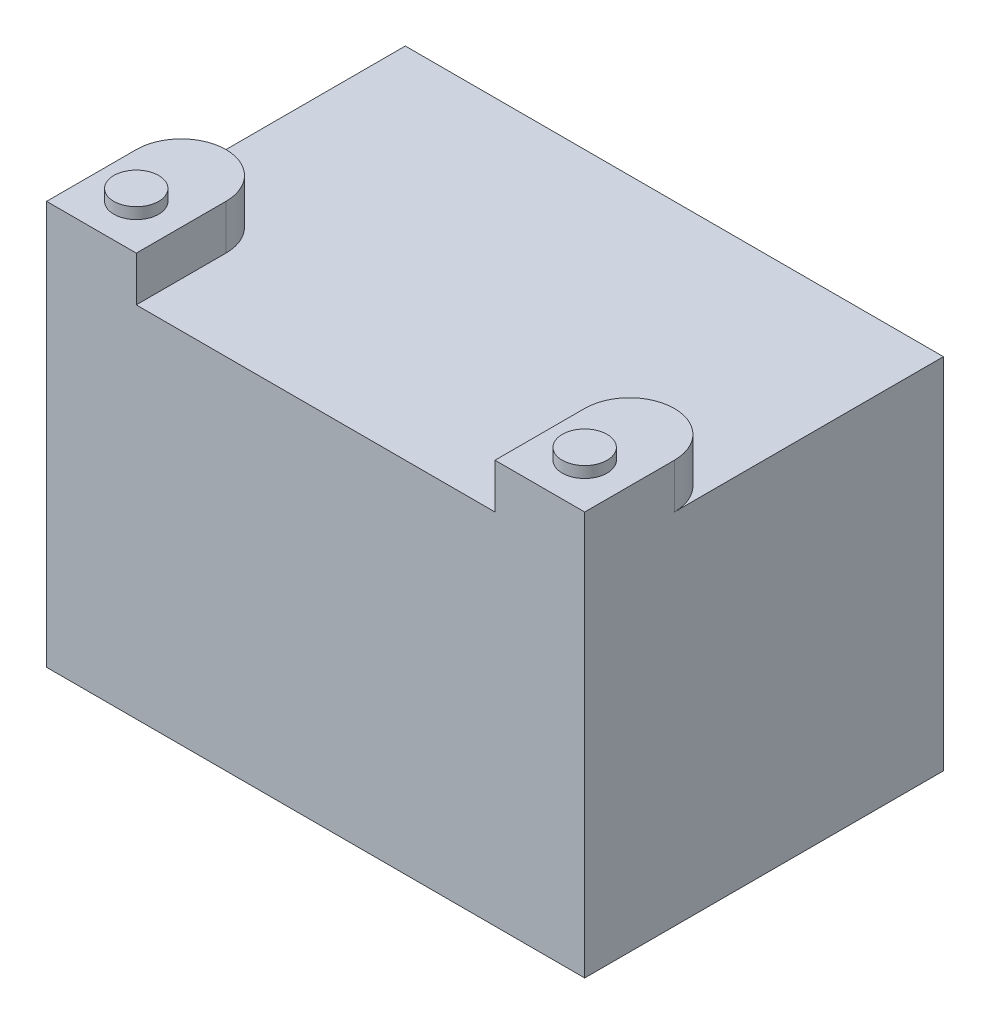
ISO-10303-21;
HEADER;
FILE_DESCRIPTION(('STEP AP214'),'2;1');
FILE_NAME('part.step','',(''),(''),'','','');
FILE_SCHEMA(('AUTOMOTIVE_DESIGN { 1 0 10303 214 1 1 1 1 }'));
ENDSEC;
DATA;
#1=APPLICATION_CONTEXT('core data for automotive mechanical design processes');
#2=APPLICATION_PROTOCOL_DEFINITION('international standard','automotive_design',2000,#1);
#3=PRODUCT_CONTEXT('',#1,'mechanical');
#4=PRODUCT('Part','Part','',(#3));
#5=PRODUCT_RELATED_PRODUCT_CATEGORY('part','',(#4));
#6=PRODUCT_DEFINITION_FORMATION('','',#4);
#7=PRODUCT_DEFINITION_CONTEXT('part definition',#1,'design');
#8=PRODUCT_DEFINITION('design','',#6,#7);
#9=PRODUCT_DEFINITION_SHAPE('','',#8);
#10=(LENGTH_UNIT() NAMED_UNIT(*) SI_UNIT(.MILLI.,.METRE.));
#11=(NAMED_UNIT(*) PLANE_ANGLE_UNIT() SI_UNIT($,.RADIAN.));
#12=(NAMED_UNIT(*) SI_UNIT($,.STERADIAN.) SOLID_ANGLE_UNIT());
#13=UNCERTAINTY_MEASURE_WITH_UNIT(LENGTH_MEASURE(1.E-05),#10,'distance_accuracy_value','');
#14=(GEOMETRIC_REPRESENTATION_CONTEXT(3) GLOBAL_UNCERTAINTY_ASSIGNED_CONTEXT((#13)) GLOBAL_UNIT_ASSIGNED_CONTEXT((#10,
#11,#12)) REPRESENTATION_CONTEXT('',''));
#15=CARTESIAN_POINT('',(0.,0.,0.));
#16=DIRECTION('',(0.,0.,1.));
#17=DIRECTION('',(1.,0.,0.));
#18=AXIS2_PLACEMENT_3D('',#15,#16,#17);
#19=CARTESIAN_POINT('',(0.,101.6,0.));
#20=DIRECTION('',(0.,-1.,0.));
#21=DIRECTION('',(0.,0.,-1.));
#22=AXIS2_PLACEMENT_3D('',#19,#20,#21);
#23=PLANE('',#22);
#24=CARTESIAN_POINT('',(139.7,101.6,-25.4));
#25=DIRECTION('',(0.,1.,0.));
#26=DIRECTION('',(0.,0.,1.));
#27=AXIS2_PLACEMENT_3D('',#24,#25,#26);
#28=CIRCLE('',#27,12.7000000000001);
#29=CARTESIAN_POINT('',(152.4,101.6,-25.3999980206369));
#30=VERTEX_POINT('',#29);
#31=CARTESIAN_POINT('',(127.,101.6,-25.4));
#32=VERTEX_POINT('',#31);
#33=EDGE_CURVE('E247',#30,#32,#28,.T.);
#34=ORIENTED_EDGE('',*,*,#33,.F.);
#35=DIRECTION('',(0.,0.,-1.));
#36=VECTOR('',#35,1.);
#37=CARTESIAN_POINT('',(152.4,101.6,0.));
#38=LINE('',#37,#36);
#39=CARTESIAN_POINT('',(152.4,101.6,-101.6));
#40=VERTEX_POINT('',#39);
#41=EDGE_CURVE('E142',#30,#40,#38,.T.);
#42=ORIENTED_EDGE('',*,*,#41,.T.);
#43=DIRECTION('',(-1.,0.,0.));
#44=VECTOR('',#43,1.);
#45=CARTESIAN_POINT('',(0.,101.6,-101.6));
#46=LINE('',#45,#44);
#47=CARTESIAN_POINT('',(0.,101.6,-101.6));
#48=VERTEX_POINT('',#47);
#49=EDGE_CURVE('E192',#40,#48,#46,.T.);
#50=ORIENTED_EDGE('',*,*,#49,.T.);
#51=DIRECTION('',(0.,0.,1.));
#52=VECTOR('',#51,1.);
#53=CARTESIAN_POINT('',(0.,101.6,0.));
#54=LINE('',#53,#52);
#55=CARTESIAN_POINT('',(0.,101.6,-25.4));
#56=VERTEX_POINT('',#55);
#57=EDGE_CURVE('E184',#48,#56,#54,.T.);
#58=ORIENTED_EDGE('',*,*,#57,.T.);
#59=CARTESIAN_POINT('',(12.7,101.6,-25.4));
#60=DIRECTION('',(0.,1.,0.));
#61=DIRECTION('',(0.,0.,1.));
#62=AXIS2_PLACEMENT_3D('',#59,#60,#61);
#63=CIRCLE('',#62,12.7);
#64=CARTESIAN_POINT('',(25.4,101.6,-25.4));
#65=VERTEX_POINT('',#64);
#66=EDGE_CURVE('E149',#65,#56,#63,.T.);
#67=ORIENTED_EDGE('',*,*,#66,.F.);
#68=DIRECTION('',(0.,0.,-1.));
#69=VECTOR('',#68,1.);
#70=CARTESIAN_POINT('',(25.4,101.6,0.));
#71=LINE('',#70,#69);
#72=CARTESIAN_POINT('',(25.4,101.6,0.));
#73=VERTEX_POINT('',#72);
#74=EDGE_CURVE('E144',#73,#65,#71,.T.);
#75=ORIENTED_EDGE('',*,*,#74,.F.);
#76=DIRECTION('',(1.,0.,0.));
#77=VECTOR('',#76,1.);
#78=CARTESIAN_POINT('',(0.,101.6,0.));
#79=LINE('',#78,#77);
#80=CARTESIAN_POINT('',(127.,101.6,0.));
#81=VERTEX_POINT('',#80);
#82=EDGE_CURVE('E62',#73,#81,#79,.T.);
#83=ORIENTED_EDGE('',*,*,#82,.T.);
#84=DIRECTION('',(0.,0.,1.));
#85=VECTOR('',#84,1.);
#86=CARTESIAN_POINT('',(127.,101.6,0.));
#87=LINE('',#86,#85);
#88=EDGE_CURVE('E57',#32,#81,#87,.T.);
#89=ORIENTED_EDGE('',*,*,#88,.F.);
#90=EDGE_LOOP('',(#34,#42,#50,#58,#67,#75,#83,#89));
#91=FACE_BOUND('',#90,.T.);
#92=ADVANCED_FACE('F41',(#91),#23,.F.);
#93=CARTESIAN_POINT('',(0.,101.6,0.));
#94=DIRECTION('',(1.,0.,0.));
#95=DIRECTION('',(0.,0.,-1.));
#96=AXIS2_PLACEMENT_3D('',#93,#94,#95);
#97=PLANE('',#96);
#98=DIRECTION('',(0.,0.,1.));
#99=VECTOR('',#98,1.);
#100=CARTESIAN_POINT('',(0.,0.,0.));
#101=LINE('',#100,#99);
#102=CARTESIAN_POINT('',(0.,0.,-101.6));
#103=VERTEX_POINT('',#102);
#104=CARTESIAN_POINT('',(0.,0.,0.));
#105=VERTEX_POINT('',#104);
#106=EDGE_CURVE('E183',#103,#105,#101,.T.);
#107=ORIENTED_EDGE('',*,*,#106,.T.);
#108=DIRECTION('',(0.,-1.,0.));
#109=VECTOR('',#108,1.);
#110=CARTESIAN_POINT('',(0.,101.6,0.));
#111=LINE('',#110,#109);
#112=CARTESIAN_POINT('',(0.,114.3,0.));
#113=VERTEX_POINT('',#112);
#114=EDGE_CURVE('E11',#113,#105,#111,.T.);
#115=ORIENTED_EDGE('',*,*,#114,.F.);
#116=DIRECTION('',(0.,0.,1.));
#117=VECTOR('',#116,1.);
#118=CARTESIAN_POINT('',(0.,114.3,0.));
#119=LINE('',#118,#117);
#120=CARTESIAN_POINT('',(0.,114.3,-25.4));
#121=VERTEX_POINT('',#120);
#122=EDGE_CURVE('E155',#121,#113,#119,.T.);
#123=ORIENTED_EDGE('',*,*,#122,.F.);
#124=DIRECTION('',(0.,-1.,0.));
#125=VECTOR('',#124,1.);
#126=CARTESIAN_POINT('',(0.,114.3,-25.4));
#127=LINE('',#126,#125);
#128=EDGE_CURVE('E167',#121,#56,#127,.T.);
#129=ORIENTED_EDGE('',*,*,#128,.T.);
#130=ORIENTED_EDGE('',*,*,#57,.F.);
#131=DIRECTION('',(0.,-1.,0.));
#132=VECTOR('',#131,1.);
#133=CARTESIAN_POINT('',(0.,101.6,-101.6));
#134=LINE('',#133,#132);
#135=EDGE_CURVE('E195',#48,#103,#134,.T.);
#136=ORIENTED_EDGE('',*,*,#135,.T.);
#137=EDGE_LOOP('',(#107,#115,#123,#129,#130,#136));
#138=FACE_BOUND('',#137,.T.);
#139=ADVANCED_FACE('F43',(#138),#97,.F.);
#140=CARTESIAN_POINT('',(0.,101.6,0.));
#141=DIRECTION('',(0.,0.,-1.));
#142=DIRECTION('',(-1.,0.,0.));
#143=AXIS2_PLACEMENT_3D('',#140,#141,#142);
#144=PLANE('',#143);
#145=DIRECTION('',(1.,0.,0.));
#146=VECTOR('',#145,1.);
#147=CARTESIAN_POINT('',(0.,0.,0.));
#148=LINE('',#147,#146);
#149=CARTESIAN_POINT('',(152.4,0.,0.));
#150=VERTEX_POINT('',#149);
#151=EDGE_CURVE('E199',#105,#150,#148,.T.);
#152=ORIENTED_EDGE('',*,*,#151,.T.);
#153=DIRECTION('',(0.,-1.,0.));
#154=VECTOR('',#153,1.);
#155=CARTESIAN_POINT('',(152.4,101.6,0.));
#156=LINE('',#155,#154);
#157=CARTESIAN_POINT('',(152.4,114.3,0.));
#158=VERTEX_POINT('',#157);
#159=EDGE_CURVE('E50',#158,#150,#156,.T.);
#160=ORIENTED_EDGE('',*,*,#159,.F.);
#161=DIRECTION('',(1.,0.,0.));
#162=VECTOR('',#161,1.);
#163=CARTESIAN_POINT('',(152.4,114.3,0.));
#164=LINE('',#163,#162);
#165=CARTESIAN_POINT('',(127.,114.3,0.));
#166=VERTEX_POINT('',#165);
#167=EDGE_CURVE('E135',#166,#158,#164,.T.);
#168=ORIENTED_EDGE('',*,*,#167,.F.);
#169=DIRECTION('',(0.,-1.,0.));
#170=VECTOR('',#169,1.);
#171=CARTESIAN_POINT('',(127.,114.3,0.));
#172=LINE('',#171,#170);
#173=EDGE_CURVE('E151',#166,#81,#172,.T.);
#174=ORIENTED_EDGE('',*,*,#173,.T.);
#175=ORIENTED_EDGE('',*,*,#82,.F.);
#176=DIRECTION('',(0.,-1.,0.));
#177=VECTOR('',#176,1.);
#178=CARTESIAN_POINT('',(25.4,114.3,0.));
#179=LINE('',#178,#177);
#180=CARTESIAN_POINT('',(25.4,114.3,0.));
#181=VERTEX_POINT('',#180);
#182=EDGE_CURVE('E179',#181,#73,#179,.T.);
#183=ORIENTED_EDGE('',*,*,#182,.F.);
#184=DIRECTION('',(1.,0.,0.));
#185=VECTOR('',#184,1.);
#186=CARTESIAN_POINT('',(0.,114.3,0.));
#187=LINE('',#186,#185);
#188=EDGE_CURVE('E159',#113,#181,#187,.T.);
#189=ORIENTED_EDGE('',*,*,#188,.F.);
#190=ORIENTED_EDGE('',*,*,#114,.T.);
#191=EDGE_LOOP('',(#152,#160,#168,#174,#175,#183,#189,#190));
#192=FACE_BOUND('',#191,.T.);
#193=ADVANCED_FACE('F237',(#192),#144,.F.);
#194=CARTESIAN_POINT('',(152.4,101.6,0.));
#195=DIRECTION('',(-1.,0.,0.));
#196=DIRECTION('',(0.,0.,1.));
#197=AXIS2_PLACEMENT_3D('',#194,#195,#196);
#198=PLANE('',#197);
#199=DIRECTION('',(0.,0.,-1.));
#200=VECTOR('',#199,1.);
#201=CARTESIAN_POINT('',(152.4,0.,0.));
#202=LINE('',#201,#200);
#203=CARTESIAN_POINT('',(152.4,0.,-101.6));
#204=VERTEX_POINT('',#203);
#205=EDGE_CURVE('E202',#150,#204,#202,.T.);
#206=ORIENTED_EDGE('',*,*,#205,.T.);
#207=DIRECTION('',(0.,-1.,0.));
#208=VECTOR('',#207,1.);
#209=CARTESIAN_POINT('',(152.4,101.6,-101.6));
#210=LINE('',#209,#208);
#211=EDGE_CURVE('E210',#40,#204,#210,.T.);
#212=ORIENTED_EDGE('',*,*,#211,.F.);
#213=ORIENTED_EDGE('',*,*,#41,.F.);
#214=DIRECTION('',(0.,-1.,0.));
#215=VECTOR('',#214,1.);
#216=CARTESIAN_POINT('',(152.4,114.3,-25.3999980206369));
#217=LINE('',#216,#215);
#218=CARTESIAN_POINT('',(152.4,114.3,-25.3999980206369));
#219=VERTEX_POINT('',#218);
#220=EDGE_CURVE('E122',#219,#30,#217,.T.);
#221=ORIENTED_EDGE('',*,*,#220,.F.);
#222=DIRECTION('',(0.,0.,-1.));
#223=VECTOR('',#222,1.);
#224=CARTESIAN_POINT('',(152.4,114.3,0.));
#225=LINE('',#224,#223);
#226=EDGE_CURVE('E129',#158,#219,#225,.T.);
#227=ORIENTED_EDGE('',*,*,#226,.F.);
#228=ORIENTED_EDGE('',*,*,#159,.T.);
#229=EDGE_LOOP('',(#206,#212,#213,#221,#227,#228));
#230=FACE_BOUND('',#229,.T.);
#231=ADVANCED_FACE('F140',(#230),#198,.F.);
#232=CARTESIAN_POINT('',(0.,101.6,-101.6));
#233=DIRECTION('',(0.,0.,1.));
#234=DIRECTION('',(1.,0.,0.));
#235=AXIS2_PLACEMENT_3D('',#232,#233,#234);
#236=PLANE('',#235);
#237=DIRECTION('',(-1.,0.,0.));
#238=VECTOR('',#237,1.);
#239=CARTESIAN_POINT('',(0.,0.,-101.6));
#240=LINE('',#239,#238);
#241=EDGE_CURVE('E187',#204,#103,#240,.T.);
#242=ORIENTED_EDGE('',*,*,#241,.T.);
#243=ORIENTED_EDGE('',*,*,#135,.F.);
#244=ORIENTED_EDGE('',*,*,#49,.F.);
#245=ORIENTED_EDGE('',*,*,#211,.T.);
#246=EDGE_LOOP('',(#242,#243,#244,#245));
#247=FACE_BOUND('',#246,.T.);
#248=ADVANCED_FACE('F222',(#247),#236,.F.);
#249=CARTESIAN_POINT('',(0.,0.,0.));
#250=DIRECTION('',(0.,-1.,0.));
#251=DIRECTION('',(0.,0.,-1.));
#252=AXIS2_PLACEMENT_3D('',#249,#250,#251);
#253=PLANE('',#252);
#254=ORIENTED_EDGE('',*,*,#106,.F.);
#255=ORIENTED_EDGE('',*,*,#241,.F.);
#256=ORIENTED_EDGE('',*,*,#205,.F.);
#257=ORIENTED_EDGE('',*,*,#151,.F.);
#258=EDGE_LOOP('',(#254,#255,#256,#257));
#259=FACE_BOUND('',#258,.T.);
#260=ADVANCED_FACE('F219',(#259),#253,.T.);
#261=CARTESIAN_POINT('',(25.4,114.3,0.));
#262=DIRECTION('',(-1.,0.,0.));
#263=DIRECTION('',(0.,0.,1.));
#264=AXIS2_PLACEMENT_3D('',#261,#262,#263);
#265=PLANE('',#264);
#266=ORIENTED_EDGE('',*,*,#74,.T.);
#267=DIRECTION('',(0.,-1.,0.));
#268=VECTOR('',#267,1.);
#269=CARTESIAN_POINT('',(25.4,114.3,-25.4));
#270=LINE('',#269,#268);
#271=CARTESIAN_POINT('',(25.4,114.3,-25.4));
#272=VERTEX_POINT('',#271);
#273=EDGE_CURVE('E175',#272,#65,#270,.T.);
#274=ORIENTED_EDGE('',*,*,#273,.F.);
#275=DIRECTION('',(0.,0.,-1.));
#276=VECTOR('',#275,1.);
#277=CARTESIAN_POINT('',(25.4,114.3,0.));
#278=LINE('',#277,#276);
#279=EDGE_CURVE('E162',#181,#272,#278,.T.);
#280=ORIENTED_EDGE('',*,*,#279,.F.);
#281=ORIENTED_EDGE('',*,*,#182,.T.);
#282=EDGE_LOOP('',(#266,#274,#280,#281));
#283=FACE_BOUND('',#282,.T.);
#284=ADVANCED_FACE('F234',(#283),#265,.F.);
#285=CARTESIAN_POINT('',(12.7,114.3,-25.4));
#286=DIRECTION('',(0.,-1.,0.));
#287=DIRECTION('',(0.,0.,-1.));
#288=AXIS2_PLACEMENT_3D('',#285,#286,#287);
#289=CYLINDRICAL_SURFACE('',#288,12.7);
#290=ORIENTED_EDGE('',*,*,#66,.T.);
#291=ORIENTED_EDGE('',*,*,#128,.F.);
#292=CARTESIAN_POINT('',(12.7,114.3,-25.4));
#293=DIRECTION('',(0.,1.,0.));
#294=DIRECTION('',(0.,0.,1.));
#295=AXIS2_PLACEMENT_3D('',#292,#293,#294);
#296=CIRCLE('',#295,12.7);
#297=EDGE_CURVE('E165',#272,#121,#296,.T.);
#298=ORIENTED_EDGE('',*,*,#297,.F.);
#299=ORIENTED_EDGE('',*,*,#273,.T.);
#300=EDGE_LOOP('',(#290,#291,#298,#299));
#301=FACE_BOUND('',#300,.T.);
#302=ADVANCED_FACE('F229',(#301),#289,.T.);
#303=CARTESIAN_POINT('',(12.7,114.3,-25.4));
#304=DIRECTION('',(0.,1.,0.));
#305=DIRECTION('',(0.,0.,1.));
#306=AXIS2_PLACEMENT_3D('',#303,#304,#305);
#307=PLANE('',#306);
#308=CARTESIAN_POINT('',(12.7,114.3,-12.7));
#309=DIRECTION('',(0.,1.,0.));
#310=DIRECTION('',(0.,0.,1.));
#311=AXIS2_PLACEMENT_3D('',#308,#309,#310);
#312=CIRCLE('',#311,6.35);
#313=CARTESIAN_POINT('',(12.7,114.3,-6.35));
#314=VERTEX_POINT('',#313);
#315=EDGE_CURVE('E253',#314,#314,#312,.T.);
#316=ORIENTED_EDGE('',*,*,#315,.F.);
#317=EDGE_LOOP('',(#316));
#318=FACE_BOUND('',#317,.T.);
#319=ORIENTED_EDGE('',*,*,#122,.T.);
#320=ORIENTED_EDGE('',*,*,#188,.T.);
#321=ORIENTED_EDGE('',*,*,#279,.T.);
#322=ORIENTED_EDGE('',*,*,#297,.T.);
#323=EDGE_LOOP('',(#319,#320,#321,#322));
#324=FACE_BOUND('',#323,.T.);
#325=ADVANCED_FACE('F330',(#318,#324),#307,.T.);
#326=CARTESIAN_POINT('',(139.7,114.3,-25.4));
#327=DIRECTION('',(0.,-1.,0.));
#328=DIRECTION('',(0.,0.,-1.));
#329=AXIS2_PLACEMENT_3D('',#326,#327,#328);
#330=CYLINDRICAL_SURFACE('',#329,12.7000000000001);
#331=ORIENTED_EDGE('',*,*,#33,.T.);
#332=DIRECTION('',(0.,-1.,0.));
#333=VECTOR('',#332,1.);
#334=CARTESIAN_POINT('',(127.,114.3,-25.4));
#335=LINE('',#334,#333);
#336=CARTESIAN_POINT('',(127.,114.3,-25.4));
#337=VERTEX_POINT('',#336);
#338=EDGE_CURVE('E124',#337,#32,#335,.T.);
#339=ORIENTED_EDGE('',*,*,#338,.F.);
#340=CARTESIAN_POINT('',(139.7,114.3,-25.4));
#341=DIRECTION('',(0.,1.,0.));
#342=DIRECTION('',(0.,0.,1.));
#343=AXIS2_PLACEMENT_3D('',#340,#341,#342);
#344=CIRCLE('',#343,12.7000000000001);
#345=EDGE_CURVE('E118',#219,#337,#344,.T.);
#346=ORIENTED_EDGE('',*,*,#345,.F.);
#347=ORIENTED_EDGE('',*,*,#220,.T.);
#348=EDGE_LOOP('',(#331,#339,#346,#347));
#349=FACE_BOUND('',#348,.T.);
#350=ADVANCED_FACE('F120',(#349),#330,.T.);
#351=CARTESIAN_POINT('',(127.,114.3,0.));
#352=DIRECTION('',(1.,0.,0.));
#353=DIRECTION('',(0.,0.,-1.));
#354=AXIS2_PLACEMENT_3D('',#351,#352,#353);
#355=PLANE('',#354);
#356=ORIENTED_EDGE('',*,*,#88,.T.);
#357=ORIENTED_EDGE('',*,*,#173,.F.);
#358=DIRECTION('',(0.,0.,1.));
#359=VECTOR('',#358,1.);
#360=CARTESIAN_POINT('',(127.,114.3,0.));
#361=LINE('',#360,#359);
#362=EDGE_CURVE('E128',#337,#166,#361,.T.);
#363=ORIENTED_EDGE('',*,*,#362,.F.);
#364=ORIENTED_EDGE('',*,*,#338,.T.);
#365=EDGE_LOOP('',(#356,#357,#363,#364));
#366=FACE_BOUND('',#365,.T.);
#367=ADVANCED_FACE('F280',(#366),#355,.F.);
#368=CARTESIAN_POINT('',(139.7,114.3,-25.4));
#369=DIRECTION('',(0.,1.,0.));
#370=DIRECTION('',(0.,0.,1.));
#371=AXIS2_PLACEMENT_3D('',#368,#369,#370);
#372=PLANE('',#371);
#373=CARTESIAN_POINT('',(139.7,114.3,-12.7));
#374=DIRECTION('',(0.,1.,0.));
#375=DIRECTION('',(0.,0.,-1.));
#376=AXIS2_PLACEMENT_3D('',#373,#374,#375);
#377=CIRCLE('',#376,6.34999999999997);
#378=CARTESIAN_POINT('',(139.7,114.3,-19.05));
#379=VERTEX_POINT('',#378);
#380=EDGE_CURVE('E261',#379,#379,#377,.T.);
#381=ORIENTED_EDGE('',*,*,#380,.F.);
#382=EDGE_LOOP('',(#381));
#383=FACE_BOUND('',#382,.T.);
#384=ORIENTED_EDGE('',*,*,#226,.T.);
#385=ORIENTED_EDGE('',*,*,#345,.T.);
#386=ORIENTED_EDGE('',*,*,#362,.T.);
#387=ORIENTED_EDGE('',*,*,#167,.T.);
#388=EDGE_LOOP('',(#384,#385,#386,#387));
#389=FACE_BOUND('',#388,.T.);
#390=ADVANCED_FACE('F133',(#383,#389),#372,.T.);
#391=CARTESIAN_POINT('',(12.7,117.475,-12.7));
#392=DIRECTION('',(0.,-1.,0.));
#393=DIRECTION('',(0.,0.,-1.));
#394=AXIS2_PLACEMENT_3D('',#391,#392,#393);
#395=CYLINDRICAL_SURFACE('',#394,6.35);
#396=CARTESIAN_POINT('',(12.7,117.475,-12.7));
#397=DIRECTION('',(0.,1.,0.));
#398=DIRECTION('',(0.,0.,1.));
#399=AXIS2_PLACEMENT_3D('',#396,#397,#398);
#400=CIRCLE('',#399,6.35);
#401=CARTESIAN_POINT('',(12.7,117.475,-6.35));
#402=VERTEX_POINT('',#401);
#403=EDGE_CURVE('E249',#402,#402,#400,.T.);
#404=ORIENTED_EDGE('',*,*,#403,.F.);
#405=EDGE_LOOP('',(#404));
#406=FACE_BOUND('',#405,.T.);
#407=ORIENTED_EDGE('',*,*,#315,.T.);
#408=EDGE_LOOP('',(#407));
#409=FACE_BOUND('',#408,.T.);
#410=ADVANCED_FACE('F279',(#406,#409),#395,.T.);
#411=CARTESIAN_POINT('',(12.7,117.475,-12.7));
#412=DIRECTION('',(0.,1.,0.));
#413=DIRECTION('',(0.,0.,1.));
#414=AXIS2_PLACEMENT_3D('',#411,#412,#413);
#415=PLANE('',#414);
#416=ORIENTED_EDGE('',*,*,#403,.T.);
#417=EDGE_LOOP('',(#416));
#418=FACE_BOUND('',#417,.T.);
#419=ADVANCED_FACE('F274',(#418),#415,.T.);
#420=CARTESIAN_POINT('',(139.7,117.475,-12.7));
#421=DIRECTION('',(0.,-1.,0.));
#422=DIRECTION('',(0.,0.,-1.));
#423=AXIS2_PLACEMENT_3D('',#420,#421,#422);
#424=CYLINDRICAL_SURFACE('',#423,6.34999999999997);
#425=CARTESIAN_POINT('',(139.7,117.475,-12.7));
#426=DIRECTION('',(0.,1.,0.));
#427=DIRECTION('',(0.,0.,-1.));
#428=AXIS2_PLACEMENT_3D('',#425,#426,#427);
#429=CIRCLE('',#428,6.34999999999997);
#430=CARTESIAN_POINT('',(139.7,117.475,-19.05));
#431=VERTEX_POINT('',#430);
#432=EDGE_CURVE('E257',#431,#431,#429,.T.);
#433=ORIENTED_EDGE('',*,*,#432,.F.);
#434=EDGE_LOOP('',(#433));
#435=FACE_BOUND('',#434,.T.);
#436=ORIENTED_EDGE('',*,*,#380,.T.);
#437=EDGE_LOOP('',(#436));
#438=FACE_BOUND('',#437,.T.);
#439=ADVANCED_FACE('F271',(#435,#438),#424,.T.);
#440=CARTESIAN_POINT('',(139.7,117.475,-12.7));
#441=DIRECTION('',(0.,-1.,0.));
#442=DIRECTION('',(0.,0.,-1.));
#443=AXIS2_PLACEMENT_3D('',#440,#441,#442);
#444=PLANE('',#443);
#445=ORIENTED_EDGE('',*,*,#432,.T.);
#446=EDGE_LOOP('',(#445));
#447=FACE_BOUND('',#446,.T.);
#448=ADVANCED_FACE('F269',(#447),#444,.F.);
#449=CLOSED_SHELL('',(#92,#139,#193,#231,#248,#260,#284,#302,#325,#350,#367,#390,#410,#419,#439,#448));
#450=MANIFOLD_SOLID_BREP('B2',#449);
#451=ADVANCED_BREP_SHAPE_REPRESENTATION('',(#18,#450),#14);
#452=SHAPE_DEFINITION_REPRESENTATION(#9,#451);
ENDSEC;
END-ISO-10303-21;
